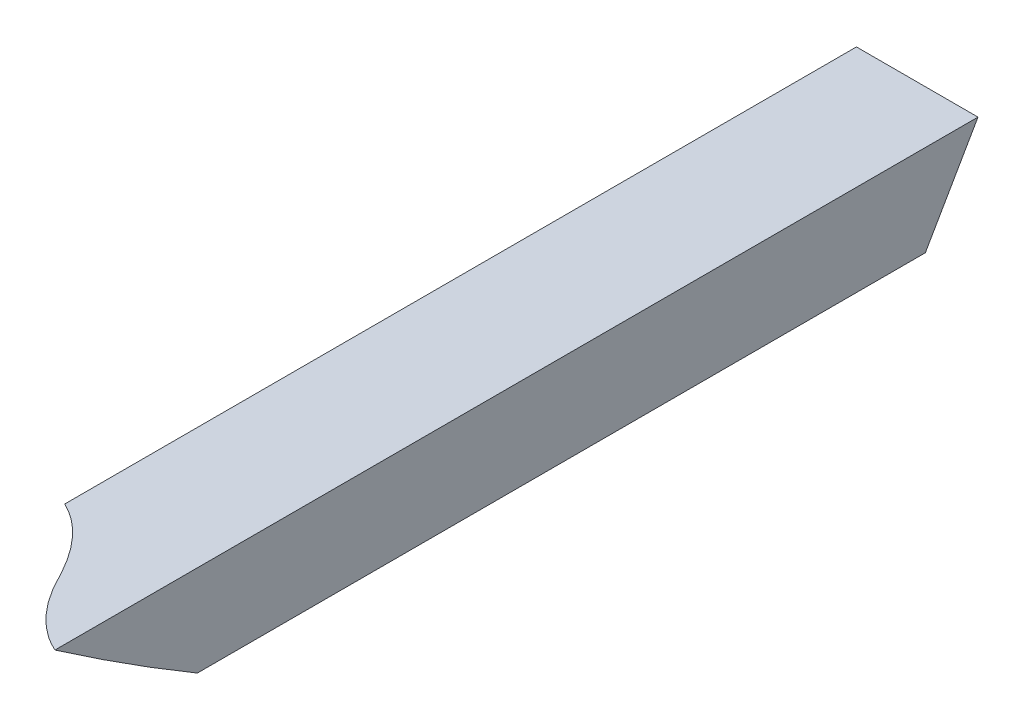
ISO-10303-21;
HEADER;
FILE_DESCRIPTION(('STEP AP214'),'2;1');
FILE_NAME('part.step','',(''),(''),'','','');
FILE_SCHEMA(('AUTOMOTIVE_DESIGN { 1 0 10303 214 1 1 1 1 }'));
ENDSEC;
DATA;
#1=APPLICATION_CONTEXT('core data for automotive mechanical design processes');
#2=APPLICATION_PROTOCOL_DEFINITION('international standard','automotive_design',2000,#1);
#3=PRODUCT_CONTEXT('',#1,'mechanical');
#4=PRODUCT('Part','Part','',(#3));
#5=PRODUCT_RELATED_PRODUCT_CATEGORY('part','',(#4));
#6=PRODUCT_DEFINITION_FORMATION('','',#4);
#7=PRODUCT_DEFINITION_CONTEXT('part definition',#1,'design');
#8=PRODUCT_DEFINITION('design','',#6,#7);
#9=PRODUCT_DEFINITION_SHAPE('','',#8);
#10=(LENGTH_UNIT() NAMED_UNIT(*) SI_UNIT(.MILLI.,.METRE.));
#11=(NAMED_UNIT(*) PLANE_ANGLE_UNIT() SI_UNIT($,.RADIAN.));
#12=(NAMED_UNIT(*) SI_UNIT($,.STERADIAN.) SOLID_ANGLE_UNIT());
#13=UNCERTAINTY_MEASURE_WITH_UNIT(LENGTH_MEASURE(1.E-05),#10,'distance_accuracy_value','');
#14=(GEOMETRIC_REPRESENTATION_CONTEXT(3) GLOBAL_UNCERTAINTY_ASSIGNED_CONTEXT((#13)) GLOBAL_UNIT_ASSIGNED_CONTEXT((#10,
#11,#12)) REPRESENTATION_CONTEXT('',''));
#15=CARTESIAN_POINT('',(0.,0.,0.));
#16=DIRECTION('',(0.,0.,1.));
#17=DIRECTION('',(1.,0.,0.));
#18=AXIS2_PLACEMENT_3D('',#15,#16,#17);
#19=CARTESIAN_POINT('',(0.,-42.1410161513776,82.8766977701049));
#20=DIRECTION('',(0.,1.,0.));
#21=DIRECTION('',(0.,0.,1.));
#22=AXIS2_PLACEMENT_3D('',#19,#20,#21);
#23=CYLINDRICAL_SURFACE('',#22,6.);
#24=CARTESIAN_POINT('',(0.,52.5,82.8766977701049));
#25=DIRECTION('',(0.,1.,0.));
#26=DIRECTION('',(0.,0.,1.));
#27=AXIS2_PLACEMENT_3D('',#24,#25,#26);
#28=CIRCLE('',#27,6.);
#29=CARTESIAN_POINT('',(-0.274833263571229,52.5,76.8829955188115));
#30=VERTEX_POINT('',#29);
#31=CARTESIAN_POINT('',(5.24029925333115,52.5,85.7988996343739));
#32=VERTEX_POINT('',#31);
#33=EDGE_CURVE('E46',#30,#32,#28,.T.);
#34=ORIENTED_EDGE('',*,*,#33,.T.);
#35=CARTESIAN_POINT('',(0.,59.069314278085,88.8766977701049));
#36=CARTESIAN_POINT('',(0.0200249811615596,59.04372412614,88.8766977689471));
#37=CARTESIAN_POINT('',(0.0400313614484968,59.0181194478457,88.8765977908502));
#38=CARTESIAN_POINT('',(0.0801232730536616,58.9669737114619,88.8761961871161));
#39=CARTESIAN_POINT('',(0.100208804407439,58.941432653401,88.8758945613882));
#40=CARTESIAN_POINT('',(0.160537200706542,58.8648707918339,88.8746847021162));
#41=CARTESIAN_POINT('',(0.200851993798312,58.8139111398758,88.8734714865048));
#42=CARTESIAN_POINT('',(0.281677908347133,58.7121736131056,88.8702186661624));
#43=CARTESIAN_POINT('',(0.322189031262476,58.6613957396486,88.8681790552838));
#44=CARTESIAN_POINT('',(0.403382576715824,58.560018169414,88.86326080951));
#45=CARTESIAN_POINT('',(0.444064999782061,58.5094184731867,88.8603821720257));
#46=CARTESIAN_POINT('',(0.566348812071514,58.3578825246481,88.8504686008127));
#47=CARTESIAN_POINT('',(0.648183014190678,58.2572141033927,88.8421561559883));
#48=CARTESIAN_POINT('',(0.812309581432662,58.056603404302,88.8220311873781));
#49=CARTESIAN_POINT('',(0.894601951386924,57.9566611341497,88.8102186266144));
#50=CARTESIAN_POINT('',(1.05949224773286,57.7574981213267,88.7830044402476));
#51=CARTESIAN_POINT('',(1.14209020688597,57.6582774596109,88.7676024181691));
#52=CARTESIAN_POINT('',(1.30740724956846,57.4605831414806,88.7331316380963));
#53=CARTESIAN_POINT('',(1.39012633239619,57.3621094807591,88.7140629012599));
#54=CARTESIAN_POINT('',(1.6381331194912,57.0679050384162,88.6512616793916));
#55=CARTESIAN_POINT('',(1.8033592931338,56.87328381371,88.6019197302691));
#56=CARTESIAN_POINT('',(2.13210119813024,56.4871566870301,88.487795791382));
#57=CARTESIAN_POINT('',(2.29561695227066,56.2956507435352,88.4230140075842));
#58=CARTESIAN_POINT('',(2.61930550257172,55.9159024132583,88.2776888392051));
#59=CARTESIAN_POINT('',(2.77947917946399,55.727659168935,88.1971496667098));
#60=CARTESIAN_POINT('',(3.11901552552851,55.3259120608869,88.0065341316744));
#61=CARTESIAN_POINT('',(3.29755853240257,55.1129564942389,87.8938229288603));
#62=CARTESIAN_POINT('',(3.64526694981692,54.6917395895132,87.6471757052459));
#63=CARTESIAN_POINT('',(3.81443314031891,54.4834778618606,87.5132414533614));
#64=CARTESIAN_POINT('',(4.14045715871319,54.072058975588,87.224569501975));
#65=CARTESIAN_POINT('',(4.29732338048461,53.8688984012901,87.0698461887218));
#66=CARTESIAN_POINT('',(4.5959625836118,53.4679461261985,86.7401903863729));
#67=CARTESIAN_POINT('',(4.73773790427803,53.2701535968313,86.5652610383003));
#68=CARTESIAN_POINT('',(4.98139288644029,52.912578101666,86.2265926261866));
#69=CARTESIAN_POINT('',(5.08599780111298,52.7518993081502,86.0657539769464));
#70=CARTESIAN_POINT('',(5.28091675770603,52.4350797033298,85.7314055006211));
#71=CARTESIAN_POINT('',(5.37123116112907,52.2789387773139,85.5578959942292));
#72=CARTESIAN_POINT('',(5.53579537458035,51.9718253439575,85.1991754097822));
#73=CARTESIAN_POINT('',(5.61005068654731,51.8208510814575,85.0139683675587));
#74=CARTESIAN_POINT('',(5.74076588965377,51.5247909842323,84.6328784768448));
#75=CARTESIAN_POINT('',(5.79722957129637,51.3797039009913,84.436997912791));
#76=CARTESIAN_POINT('',(5.88098142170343,51.1255554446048,84.0770455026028));
#77=CARTESIAN_POINT('',(5.91188067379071,51.0152178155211,83.9147089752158));
#78=CARTESIAN_POINT('',(5.96040406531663,50.7995577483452,83.5847836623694));
#79=CARTESIAN_POINT('',(5.97802865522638,50.6942351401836,83.4171950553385));
#80=CARTESIAN_POINT('',(5.99903938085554,50.4895220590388,83.0777133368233));
#81=CARTESIAN_POINT('',(6.00243792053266,50.390126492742,82.9058241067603));
#82=CARTESIAN_POINT('',(5.99408393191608,50.1982787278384,82.5586710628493));
#83=CARTESIAN_POINT('',(5.98233506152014,50.105824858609,82.3834080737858));
#84=CARTESIAN_POINT('',(5.93179277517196,49.880620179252,81.9337098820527));
#85=CARTESIAN_POINT('',(5.88171916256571,49.7534993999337,81.6574820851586));
#86=CARTESIAN_POINT('',(5.77520001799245,49.5824829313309,81.2434714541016));
#87=CARTESIAN_POINT('',(5.73445867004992,49.5287547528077,81.1055226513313));
#88=CARTESIAN_POINT('',(5.64218455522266,49.428812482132,80.8305454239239));
#89=CARTESIAN_POINT('',(5.59065868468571,49.3825936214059,80.6935164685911));
#90=CARTESIAN_POINT('',(5.48734435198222,49.3066410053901,80.4470044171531));
#91=CARTESIAN_POINT('',(5.43742586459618,49.2754415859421,80.3371852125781));
#92=CARTESIAN_POINT('',(5.33035594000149,49.2193541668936,80.119525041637));
#93=CARTESIAN_POINT('',(5.27320807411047,49.1944630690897,80.0116831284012));
#94=CARTESIAN_POINT('',(5.1517893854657,49.1516284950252,79.7986973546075));
#95=CARTESIAN_POINT('',(5.08752096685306,49.133682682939,79.6935525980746));
#96=CARTESIAN_POINT('',(4.95210077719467,49.1053510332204,79.4867161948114));
#97=CARTESIAN_POINT('',(4.88094893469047,49.0949652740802,79.3850245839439));
#98=CARTESIAN_POINT('',(4.73171409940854,49.0822724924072,79.1852859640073));
#99=CARTESIAN_POINT('',(4.65358928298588,49.0800181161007,79.087266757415));
#100=CARTESIAN_POINT('',(4.49144179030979,49.0841832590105,78.8964179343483));
#101=CARTESIAN_POINT('',(4.40741913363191,49.0906027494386,78.8035883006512));
#102=CARTESIAN_POINT('',(4.23432877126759,49.1123861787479,78.6239323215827));
#103=CARTESIAN_POINT('',(4.14526285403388,49.1277469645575,78.5371038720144));
#104=CARTESIAN_POINT('',(3.96303064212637,49.1674745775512,78.3700734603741));
#105=CARTESIAN_POINT('',(3.86986464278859,49.1918407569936,78.2898710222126));
#106=CARTESIAN_POINT('',(3.69021938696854,49.2464566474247,78.1444427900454));
#107=CARTESIAN_POINT('',(3.60403576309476,49.2758453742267,78.0785247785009));
#108=CARTESIAN_POINT('',(3.42999319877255,49.3414809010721,77.9526057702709));
#109=CARTESIAN_POINT('',(3.34213441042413,49.3777270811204,77.8926042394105));
#110=CARTESIAN_POINT('',(3.16545817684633,49.4567215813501,77.7785674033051));
#111=CARTESIAN_POINT('',(3.07664055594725,49.4994711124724,77.7245332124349));
#112=CARTESIAN_POINT('',(2.8987206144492,49.5910254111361,77.6223711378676));
#113=CARTESIAN_POINT('',(2.80961823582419,49.6398315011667,77.5742445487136));
#114=CARTESIAN_POINT('',(2.59959873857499,49.7616383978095,77.467397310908));
#115=CARTESIAN_POINT('',(2.47880719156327,49.8370134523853,77.4111232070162));
#116=CARTESIAN_POINT('',(2.23895662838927,49.9968097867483,77.3085646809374));
#117=CARTESIAN_POINT('',(2.11989846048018,50.0812353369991,77.26228500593));
#118=CARTESIAN_POINT('',(1.88425223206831,50.2580034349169,77.1788703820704));
#119=CARTESIAN_POINT('',(1.76766768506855,50.3503564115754,77.1417477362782));
#120=CARTESIAN_POINT('',(1.53776998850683,50.5417205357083,77.0758738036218));
#121=CARTESIAN_POINT('',(1.42445561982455,50.6407291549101,77.0471193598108));
#122=CARTESIAN_POINT('',(1.16856950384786,50.8744651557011,76.9897341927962));
#123=CARTESIAN_POINT('',(1.02719759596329,51.0111316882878,76.9636284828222));
#124=CARTESIAN_POINT('',(0.819891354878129,51.2220450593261,76.9325692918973));
#125=CARTESIAN_POINT('',(0.751534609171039,51.2933876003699,76.923562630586));
#126=CARTESIAN_POINT('',(0.61643585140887,51.4378548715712,76.9080605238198));
#127=CARTESIAN_POINT('',(0.549693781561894,51.5109795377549,76.9015649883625));
#128=CARTESIAN_POINT('',(0.417745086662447,51.6589426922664,76.8908915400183));
#129=CARTESIAN_POINT('',(0.352540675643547,51.7337833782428,76.8867167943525));
#130=CARTESIAN_POINT('',(0.255951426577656,51.8471439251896,76.8820728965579));
#131=CARTESIAN_POINT('',(0.223957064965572,51.8851150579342,76.8807946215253));
#132=CARTESIAN_POINT('',(0.160375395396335,51.9614098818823,76.8787571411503));
#133=CARTESIAN_POINT('',(0.128788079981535,51.9997335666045,76.8779979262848));
#134=CARTESIAN_POINT('',(0.0816329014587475,52.0575484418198,76.8772324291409));
#135=CARTESIAN_POINT('',(0.0659180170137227,52.076917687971,76.8770394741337));
#136=CARTESIAN_POINT('',(0.0346028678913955,52.1157495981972,76.8767770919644));
#137=CARTESIAN_POINT('',(0.019002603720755,52.1352122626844,76.8767076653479));
#138=CARTESIAN_POINT('',(-0.0121487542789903,52.1741772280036,76.876689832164));
#139=CARTESIAN_POINT('',(-0.0276998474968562,52.1936795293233,76.876741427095));
#140=CARTESIAN_POINT('',(-0.0588576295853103,52.232638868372,76.8769662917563));
#141=CARTESIAN_POINT('',(-0.0744643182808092,52.2520959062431,76.8771395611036));
#142=CARTESIAN_POINT('',(-0.12132735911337,52.310428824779,76.8778431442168));
#143=CARTESIAN_POINT('',(-0.152627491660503,52.3492675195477,76.8785572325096));
#144=CARTESIAN_POINT('',(-0.215355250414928,52.4268289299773,76.880481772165));
#145=CARTESIAN_POINT('',(-0.246782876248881,52.4655516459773,76.8816922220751));
#146=CARTESIAN_POINT('',(-0.341163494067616,52.5814614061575,76.886074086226));
#147=CARTESIAN_POINT('',(-0.404288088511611,52.6584819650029,76.8899970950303));
#148=CARTESIAN_POINT('',(-0.530926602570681,52.8120720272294,76.8998967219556));
#149=CARTESIAN_POINT('',(-0.594440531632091,52.8886415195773,76.9058733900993));
#150=CARTESIAN_POINT('',(-0.721762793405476,53.04130401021,76.9199235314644));
#151=CARTESIAN_POINT('',(-0.785571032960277,53.117397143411,76.9279963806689));
#152=CARTESIAN_POINT('',(-0.91342314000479,53.2691257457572,76.9462822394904));
#153=CARTESIAN_POINT('',(-0.977467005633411,53.3447612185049,76.956495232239));
#154=CARTESIAN_POINT('',(-1.10982058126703,53.5004045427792,76.9798258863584));
#155=CARTESIAN_POINT('',(-1.17814070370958,53.5803820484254,76.9930877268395));
#156=CARTESIAN_POINT('',(-1.31485785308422,53.7398112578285,77.0221240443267));
#157=CARTESIAN_POINT('',(-1.38325488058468,53.8192629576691,77.0378985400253));
#158=CARTESIAN_POINT('',(-1.58847566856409,54.056901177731,77.0890707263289));
#159=CARTESIAN_POINT('',(-1.72527274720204,54.2143046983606,77.1283072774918));
#160=CARTESIAN_POINT('',(-1.9979264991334,54.5269801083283,77.2172932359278));
#161=CARTESIAN_POINT('',(-2.13378302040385,54.6822516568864,77.267044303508));
#162=CARTESIAN_POINT('',(-2.40316266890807,54.9900777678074,77.3770702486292));
#163=CARTESIAN_POINT('',(-2.53669222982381,55.1426398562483,77.437308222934));
#164=CARTESIAN_POINT('',(-2.80093212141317,55.4455361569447,77.5685403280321));
#165=CARTESIAN_POINT('',(-2.93164281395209,55.5958706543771,77.6395330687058));
#166=CARTESIAN_POINT('',(-3.18925772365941,55.8942636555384,77.792303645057));
#167=CARTESIAN_POINT('',(-3.31616238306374,56.04232242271,77.874080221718));
#168=CARTESIAN_POINT('',(-3.60980466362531,56.3888146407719,78.0796247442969));
#169=CARTESIAN_POINT('',(-3.77452232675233,56.5862894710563,78.2079397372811));
#170=CARTESIAN_POINT('',(-4.09249084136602,56.976861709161,78.483993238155));
#171=CARTESIAN_POINT('',(-4.24574157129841,57.1699590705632,78.6317319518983));
#172=CARTESIAN_POINT('',(-4.53829704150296,57.5517495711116,78.9460495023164));
#173=CARTESIAN_POINT('',(-4.67758935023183,57.740438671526,79.1126448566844));
#174=CARTESIAN_POINT('',(-4.93945104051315,58.112905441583,79.4635273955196));
#175=CARTESIAN_POINT('',(-5.06202293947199,58.2966838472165,79.6478119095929));
#176=CARTESIAN_POINT('',(-5.2703846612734,58.630786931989,80.0029166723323));
#177=CARTESIAN_POINT('',(-5.35893098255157,58.7818829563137,80.171398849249));
#178=CARTESIAN_POINT('',(-5.52073881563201,59.0798127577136,80.5191136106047));
#179=CARTESIAN_POINT('',(-5.59400285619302,59.2266472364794,80.6983444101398));
#180=CARTESIAN_POINT('',(-5.7237022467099,59.5153800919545,81.0663732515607));
#181=CARTESIAN_POINT('',(-5.78015112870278,59.6572823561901,81.2551634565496));
#182=CARTESIAN_POINT('',(-5.87479238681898,59.9354735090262,81.6412596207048));
#183=CARTESIAN_POINT('',(-5.91298865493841,60.0717635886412,81.8385637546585));
#184=CARTESIAN_POINT('',(-5.96372965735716,60.310024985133,82.1986336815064));
#185=CARTESIAN_POINT('',(-5.97995460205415,60.4132445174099,82.3600608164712));
#186=CARTESIAN_POINT('',(-5.99922392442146,60.6147852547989,82.6867359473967));
#187=CARTESIAN_POINT('',(-6.00226870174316,60.7131066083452,82.8519838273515));
#188=CARTESIAN_POINT('',(-5.99437082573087,60.9038924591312,83.1853836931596));
#189=CARTESIAN_POINT('',(-5.98343846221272,60.9963612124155,83.353533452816));
#190=CARTESIAN_POINT('',(-5.94681226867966,61.1743312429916,83.691805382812));
#191=CARTESIAN_POINT('',(-5.92112222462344,61.2598343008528,83.8619270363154));
#192=CARTESIAN_POINT('',(-5.83640644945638,61.4655074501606,84.2933051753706));
#193=CARTESIAN_POINT('',(-5.76694796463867,61.5802028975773,84.5553459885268));
#194=CARTESIAN_POINT('',(-5.63363767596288,61.7325672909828,84.9457768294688));
#195=CARTESIAN_POINT('',(-5.58435105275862,61.7800733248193,85.0754742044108));
#196=CARTESIAN_POINT('',(-5.47585509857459,61.8675372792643,85.3332236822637));
#197=CARTESIAN_POINT('',(-5.41665214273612,61.9075000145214,85.4612767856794));
#198=CARTESIAN_POINT('',(-5.30032511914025,61.9720759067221,85.6909247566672));
#199=CARTESIAN_POINT('',(-5.24490069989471,61.9981623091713,85.7929700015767));
#200=CARTESIAN_POINT('',(-5.12755463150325,62.0439958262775,85.9946753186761));
#201=CARTESIAN_POINT('',(-5.06563619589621,62.0637460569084,86.0943365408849));
#202=CARTESIAN_POINT('',(-4.9354975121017,62.0962901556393,86.2905991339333));
#203=CARTESIAN_POINT('',(-4.8672794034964,62.1090863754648,86.3872015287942));
#204=CARTESIAN_POINT('',(-4.72486934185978,62.1271498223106,86.5766504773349));
#205=CARTESIAN_POINT('',(-4.65067733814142,62.1324169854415,86.6694969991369));
#206=CARTESIAN_POINT('',(-4.49638589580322,62.1349379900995,86.8512169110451));
#207=CARTESIAN_POINT('',(-4.41625425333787,62.1321444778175,86.9400636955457));
#208=CARTESIAN_POINT('',(-4.25117786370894,62.1180897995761,87.1124655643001));
#209=CARTESIAN_POINT('',(-4.16623314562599,62.106828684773,87.1960206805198));
#210=CARTESIAN_POINT('',(-3.99242576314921,62.0756876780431,87.3571637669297));
#211=CARTESIAN_POINT('',(-3.90356478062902,62.0558114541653,87.4347542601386));
#212=CARTESIAN_POINT('',(-3.72285094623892,62.0074999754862,87.5835095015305));
#213=CARTESIAN_POINT('',(-3.63099822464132,61.9790650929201,87.6546745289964));
#214=CARTESIAN_POINT('',(-3.45367030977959,61.9168509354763,87.7841522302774));
#215=CARTESIAN_POINT('',(-3.36836639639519,61.8837842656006,87.8430451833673));
#216=CARTESIAN_POINT('',(-3.19679321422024,61.8111168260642,87.9551838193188));
#217=CARTESIAN_POINT('',(-3.11052360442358,61.7715136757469,88.0084274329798));
#218=CARTESIAN_POINT('',(-2.9376606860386,61.6861846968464,88.1093044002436));
#219=CARTESIAN_POINT('',(-2.8510672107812,61.6404551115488,88.1569342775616));
#220=CARTESIAN_POINT('',(-2.67817192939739,61.5433756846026,88.2466966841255));
#221=CARTESIAN_POINT('',(-2.59187019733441,61.4920245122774,88.2888279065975));
#222=CARTESIAN_POINT('',(-2.38129623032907,61.3598959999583,88.3856221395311));
#223=CARTESIAN_POINT('',(-2.25744884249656,61.2762905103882,88.4373702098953));
#224=CARTESIAN_POINT('',(-2.01250754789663,61.0998557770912,88.530635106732));
#225=CARTESIAN_POINT('',(-1.89141472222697,61.0070229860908,88.5721479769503));
#226=CARTESIAN_POINT('',(-1.65271859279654,60.8135501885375,88.6459376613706));
#227=CARTESIAN_POINT('',(-1.53511577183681,60.7129091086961,88.6782132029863));
#228=CARTESIAN_POINT('',(-1.30384162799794,60.5050536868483,88.7345271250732));
#229=CARTESIAN_POINT('',(-1.19017032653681,60.397839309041,88.7585654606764));
#230=CARTESIAN_POINT('',(-1.01454861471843,60.2247606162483,88.7906579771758));
#231=CARTESIAN_POINT('',(-0.951198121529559,60.1607428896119,88.8011585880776));
#232=CARTESIAN_POINT('',(-0.82588712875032,60.0310602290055,88.8199228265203));
#233=CARTESIAN_POINT('',(-0.763926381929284,59.9653955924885,88.8281868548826));
#234=CARTESIAN_POINT('',(-0.641414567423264,59.8325867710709,88.842633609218));
#235=CARTESIAN_POINT('',(-0.580863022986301,59.7654431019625,88.8488170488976));
#236=CARTESIAN_POINT('',(-0.461067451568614,59.6297035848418,88.8592587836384));
#237=CARTESIAN_POINT('',(-0.401825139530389,59.5611060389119,88.8635146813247));
#238=CARTESIAN_POINT('',(-0.313991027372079,59.4572691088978,88.8685480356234));
#239=CARTESIAN_POINT('',(-0.28488193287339,59.4224968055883,88.8700008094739));
#240=CARTESIAN_POINT('',(-0.227005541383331,59.3526550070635,88.872471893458));
#241=CARTESIAN_POINT('',(-0.198238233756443,59.3175855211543,88.8734902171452));
#242=CARTESIAN_POINT('',(-0.141031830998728,59.2471399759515,88.8751083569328));
#243=CARTESIAN_POINT('',(-0.11259291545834,59.2117637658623,88.8757079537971));
#244=CARTESIAN_POINT('',(-0.0701779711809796,59.1585012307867,88.8763039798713));
#245=CARTESIAN_POINT('',(-0.056079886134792,59.1407135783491,88.8764520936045));
#246=CARTESIAN_POINT('',(-0.0279848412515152,59.10505773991,88.8766489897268));
#247=CARTESIAN_POINT('',(-0.0139878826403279,59.0871895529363,88.8766977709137));
#248=CARTESIAN_POINT('',(0.,59.069314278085,88.8766977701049));
#249=B_SPLINE_CURVE_WITH_KNOTS('',3,(#35,#36,#37,#38,#39,#40,#41,#42,#43,#44,#45,#46,#47,#48,
#49,#50,#51,#52,#53,#54,#55,#56,#57,#58,#59,#60,#61,#62,#63,#64,#65,#66,#67,#68,#69,#70,#71,#72,
#73,#74,#75,#76,#77,#78,#79,#80,#81,#82,#83,#84,#85,#86,#87,#88,#89,#90,#91,#92,#93,#94,#95,#96,
#97,#98,#99,#100,#101,#102,#103,#104,#105,#106,#107,#108,#109,#110,#111,#112,#113,#114,#115,
#116,#117,#118,#119,#120,#121,#122,#123,#124,#125,#126,#127,#128,#129,#130,#131,#132,#133,#134,
#135,#136,#137,#138,#139,#140,#141,#142,#143,#144,#145,#146,#147,#148,#149,#150,#151,#152,#153,
#154,#155,#156,#157,#158,#159,#160,#161,#162,#163,#164,#165,#166,#167,#168,#169,#170,#171,#172,
#173,#174,#175,#176,#177,#178,#179,#180,#181,#182,#183,#184,#185,#186,#187,#188,#189,#190,#191,
#192,#193,#194,#195,#196,#197,#198,#199,#200,#201,#202,#203,#204,#205,#206,#207,#208,#209,#210,
#211,#212,#213,#214,#215,#216,#217,#218,#219,#220,#221,#222,#223,#224,#225,#226,#227,#228,#229,
#230,#231,#232,#233,#234,#235,#236,#237,#238,#239,#240,#241,#242,#243,#244,#245,#246,#247,#248),
.UNSPECIFIED.,.T.,.F.,(4,2,2,2,2,2,2,2,2,2,2,2,2,2,2,2,2,2,2,2,2,2,2,2,2,2,2,2,2,2,2,2,2,2,2,2,
2,2,2,2,2,2,2,2,2,2,2,2,2,2,2,2,2,2,2,2,2,2,2,2,2,2,2,2,2,2,2,2,2,2,2,2,2,2,2,2,2,2,2,2,2,2,2,2,
2,2,2,2,2,2,2,2,2,2,2,2,2,2,2,2,2,2,2,2,2,2,4),(0.,0.0974815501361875,0.194963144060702,
0.389925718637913,0.584889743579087,0.779854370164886,1.16980160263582,1.55975295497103,
1.94974739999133,2.33973959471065,3.11930501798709,3.89886004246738,4.67820696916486,
5.57695248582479,6.47562313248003,7.37367506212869,8.27158757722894,9.02164667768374,
9.77168680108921,10.5214695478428,11.2710924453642,11.8666689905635,12.4622253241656,
13.0572622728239,13.6521555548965,14.5725476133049,15.0327465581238,15.4926521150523,
15.866107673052,16.2393794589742,16.6125255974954,16.9856756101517,17.3612372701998,
17.7367976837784,18.1122257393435,18.4876267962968,18.824482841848,19.1613084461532,
19.4981968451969,19.8351589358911,20.2937517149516,20.7525618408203,21.2119850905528,
21.6712347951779,22.2655907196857,22.5631894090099,22.8607774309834,23.1587705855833,
23.3077751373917,23.4567769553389,23.5316059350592,23.6064352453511,23.6812654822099,
23.7560954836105,23.9057516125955,24.0554073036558,24.3543650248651,24.6533300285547,
24.9522061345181,25.2510798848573,25.569102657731,25.8871277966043,26.5234401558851,
27.159853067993,27.7940701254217,28.4282052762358,29.0622664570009,29.9235145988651,
30.7847718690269,31.6467894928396,32.5086771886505,33.2370197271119,33.9652416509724,
34.6928759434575,35.4203550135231,35.9967257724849,36.5730790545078,37.1490082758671,
37.7247898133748,38.6039821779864,39.0435246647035,39.482785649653,39.8395088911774,
40.1960564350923,40.5524833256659,40.9089132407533,41.2674413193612,41.6259672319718,
41.9843406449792,42.3426984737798,42.6687600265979,42.994940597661,43.3213221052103,
43.6477810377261,44.1214376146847,44.5952769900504,45.0691816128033,45.5430888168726,
45.8150653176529,46.0869930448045,46.3588273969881,46.6309989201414,46.7671095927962,
46.903216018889,47.0393936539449,47.1074858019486,47.1755787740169),.UNSPECIFIED.);
#250=EDGE_CURVE('E11',#30,#32,#249,.T.);
#251=ORIENTED_EDGE('',*,*,#250,.F.);
#252=EDGE_LOOP('',(#34,#251));
#253=FACE_BOUND('',#252,.T.);
#254=ADVANCED_FACE('F33',(#253),#23,.T.);
#255=CARTESIAN_POINT('',(-30.,117.320508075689,163.205080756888));
#256=CARTESIAN_POINT('',(-30.,107.117483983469,152.415825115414));
#257=CARTESIAN_POINT('',(-30.,94.1304442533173,138.682593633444));
#258=CARTESIAN_POINT('',(-30.,76.0781440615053,115.118979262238));
#259=CARTESIAN_POINT('',(-30.,63.1328522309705,96.1586042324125));
#260=CARTESIAN_POINT('',(-30.,48.2906753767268,70.4512062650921));
#261=CARTESIAN_POINT('',(-30.,38.34315405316,49.7601899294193));
#262=CARTESIAN_POINT('',(-30.,26.9626094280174,22.3446571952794));
#263=CARTESIAN_POINT('',(-30.,21.5627895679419,4.2308336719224));
#264=CARTESIAN_POINT('',(-30.,17.3205080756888,-10.));
#265=CARTESIAN_POINT('',(-29.0650994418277,118.238562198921,162.675041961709));
#266=CARTESIAN_POINT('',(-29.0623754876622,108.031252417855,151.889577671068));
#267=CARTESIAN_POINT('',(-29.0589082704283,95.0387575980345,138.161172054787));
#268=CARTESIAN_POINT('',(-29.0557820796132,76.9805247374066,114.600117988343));
#269=CARTESIAN_POINT('',(-29.0543707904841,64.032135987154,95.6401689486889));
#270=CARTESIAN_POINT('',(-29.0543707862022,49.1892948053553,69.9316203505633));
#271=CARTESIAN_POINT('',(-29.0557820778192,39.2436905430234,49.238134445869));
#272=CARTESIAN_POINT('',(-29.0589083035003,27.8683306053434,21.818745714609));
#273=CARTESIAN_POINT('',(-29.0623754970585,22.4754175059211,3.70261079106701));
#274=CARTESIAN_POINT('',(-29.0650994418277,18.2385621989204,-10.5300387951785));
#275=CARTESIAN_POINT('',(-26.9698133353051,119.902394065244,161.714428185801));
#276=CARTESIAN_POINT('',(-26.9618430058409,109.684748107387,150.937310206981));
#277=CARTESIAN_POINT('',(-26.9516978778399,96.6790967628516,137.219528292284));
#278=CARTESIAN_POINT('',(-26.9430182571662,78.6078459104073,113.664420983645));
#279=CARTESIAN_POINT('',(-26.9390611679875,65.6527599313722,94.7058822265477));
#280=CARTESIAN_POINT('',(-26.9390611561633,50.808721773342,68.9952604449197));
#281=CARTESIAN_POINT('',(-26.9430182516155,40.8676868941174,48.2966787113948));
#282=CARTESIAN_POINT('',(-26.9516979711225,29.5039879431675,20.8689924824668));
#283=CARTESIAN_POINT('',(-26.9618430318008,24.1268532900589,2.74677538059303));
#284=CARTESIAN_POINT('',(-26.9698133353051,19.9023940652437,-11.4906525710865));
#285=CARTESIAN_POINT('',(-23.2906453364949,121.769380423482,160.636523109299));
#286=CARTESIAN_POINT('',(-23.28048493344,111.537390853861,149.870346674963));
#287=CARTESIAN_POINT('',(-23.2675521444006,98.51348207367,136.166491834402));
#288=CARTESIAN_POINT('',(-23.2555317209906,80.4222369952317,112.621158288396));
#289=CARTESIAN_POINT('',(-23.2501997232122,67.4575031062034,93.6654505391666));
#290=CARTESIAN_POINT('',(-23.2501997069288,52.6121324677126,67.9525208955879));
#291=CARTESIAN_POINT('',(-23.2555317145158,42.6783726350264,47.2469982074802));
#292=CARTESIAN_POINT('',(-23.2675522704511,31.3331373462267,19.8068867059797));
#293=CARTESIAN_POINT('',(-23.2804849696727,25.9771923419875,1.67582159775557));
#294=CARTESIAN_POINT('',(-23.2906453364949,21.7693804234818,-12.5685576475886));
#295=CARTESIAN_POINT('',(-19.2402865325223,122.92413557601,159.96982491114));
#296=CARTESIAN_POINT('',(-19.2329440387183,112.678853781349,149.212954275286));
#297=CARTESIAN_POINT('',(-19.223598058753,99.6380258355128,135.52094443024));
#298=CARTESIAN_POINT('',(-19.2158622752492,81.5330652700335,111.982438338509));
#299=CARTESIAN_POINT('',(-19.2123403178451,68.5614053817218,93.0290523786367));
#300=CARTESIAN_POINT('',(-19.2123403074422,53.7152198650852,67.3147113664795));
#301=CARTESIAN_POINT('',(-19.2158622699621,43.786933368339,46.604350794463));
#302=CARTESIAN_POINT('',(-19.2235981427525,32.4544699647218,19.1557770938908));
#303=CARTESIAN_POINT('',(-19.2329440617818,27.117242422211,1.0159819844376));
#304=CARTESIAN_POINT('',(-19.2402865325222,22.9241355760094,-13.2352558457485));
#305=CARTESIAN_POINT('',(-15.,123.314869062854,159.744234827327));
#306=CARTESIAN_POINT('',(-15.,113.067208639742,148.989296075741));
#307=CARTESIAN_POINT('',(-15.0000000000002,100.023353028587,135.299745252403));
#308=CARTESIAN_POINT('',(-14.9999999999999,81.9123877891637,111.764330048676));
#309=CARTESIAN_POINT('',(-15.,68.9381821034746,92.8118410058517));
#310=CARTESIAN_POINT('',(-15.0000000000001,54.0917185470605,67.0970184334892));
#311=CARTESIAN_POINT('',(-14.9999999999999,44.1654815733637,46.384901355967));
#312=CARTESIAN_POINT('',(-15.0000000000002,32.8386977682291,18.9326735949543));
#313=CARTESIAN_POINT('',(-15.0000000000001,27.5051135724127,0.791485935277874));
#314=CARTESIAN_POINT('',(-15.,23.3148690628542,-13.4608459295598));
#315=CARTESIAN_POINT('',(-10.7597134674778,122.92413557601,159.96982491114));
#316=CARTESIAN_POINT('',(-10.7670559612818,112.678853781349,149.212954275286));
#317=CARTESIAN_POINT('',(-10.776401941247,99.638025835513,135.52094443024));
#318=CARTESIAN_POINT('',(-10.7841377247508,81.5330652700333,111.982438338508));
#319=CARTESIAN_POINT('',(-10.7876596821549,68.5614053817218,93.0290523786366));
#320=CARTESIAN_POINT('',(-10.7876596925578,53.7152198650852,67.3147113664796));
#321=CARTESIAN_POINT('',(-10.784137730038,43.7869333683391,46.6043507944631));
#322=CARTESIAN_POINT('',(-10.7764018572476,32.4544699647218,19.1557770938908));
#323=CARTESIAN_POINT('',(-10.7670559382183,27.117242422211,1.01598198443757));
#324=CARTESIAN_POINT('',(-10.7597134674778,22.9241355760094,-13.2352558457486));
#325=CARTESIAN_POINT('',(-6.70935466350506,121.769380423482,160.636523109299));
#326=CARTESIAN_POINT('',(-6.71951506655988,111.537390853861,149.870346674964));
#327=CARTESIAN_POINT('',(-6.73244785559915,98.5134820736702,136.166491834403));
#328=CARTESIAN_POINT('',(-6.74446827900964,80.4222369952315,112.621158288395));
#329=CARTESIAN_POINT('',(-6.74980027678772,67.4575031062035,93.6654505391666));
#330=CARTESIAN_POINT('',(-6.74980029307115,52.6121324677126,67.9525208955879));
#331=CARTESIAN_POINT('',(-6.74446828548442,42.6783726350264,47.2469982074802));
#332=CARTESIAN_POINT('',(-6.73244772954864,31.3331373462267,19.8068867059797));
#333=CARTESIAN_POINT('',(-6.71951503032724,25.9771923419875,1.67582159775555));
#334=CARTESIAN_POINT('',(-6.7093546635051,21.7693804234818,-12.5685576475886));
#335=CARTESIAN_POINT('',(-3.03018666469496,119.902394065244,161.714428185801));
#336=CARTESIAN_POINT('',(-3.03815699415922,109.684748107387,150.937310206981));
#337=CARTESIAN_POINT('',(-3.04830212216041,96.6790967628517,137.219528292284));
#338=CARTESIAN_POINT('',(-3.05698174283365,78.6078459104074,113.664420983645));
#339=CARTESIAN_POINT('',(-3.06093883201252,65.6527599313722,94.7058822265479));
#340=CARTESIAN_POINT('',(-3.06093884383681,50.8087217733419,68.9952604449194));
#341=CARTESIAN_POINT('',(-3.0569817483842,40.8676868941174,48.2966787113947));
#342=CARTESIAN_POINT('',(-3.04830202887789,29.5039879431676,20.8689924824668));
#343=CARTESIAN_POINT('',(-3.03815696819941,24.126853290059,2.74677538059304));
#344=CARTESIAN_POINT('',(-3.03018666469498,19.9023940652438,-11.4906525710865));
#345=CARTESIAN_POINT('',(-0.934900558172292,118.238562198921,162.675041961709));
#346=CARTESIAN_POINT('',(-0.937624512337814,108.031252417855,151.889577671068));
#347=CARTESIAN_POINT('',(-0.941091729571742,95.0387575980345,138.161172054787));
#348=CARTESIAN_POINT('',(-0.944217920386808,76.9805247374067,114.600117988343));
#349=CARTESIAN_POINT('',(-0.945629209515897,64.0321359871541,95.6401689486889));
#350=CARTESIAN_POINT('',(-0.945629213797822,49.1892948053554,69.9316203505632));
#351=CARTESIAN_POINT('',(-0.944217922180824,39.2436905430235,49.2381344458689));
#352=CARTESIAN_POINT('',(-0.94109169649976,27.8683306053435,21.8187457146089));
#353=CARTESIAN_POINT('',(-0.937624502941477,22.4754175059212,3.70261079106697));
#354=CARTESIAN_POINT('',(-0.934900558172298,18.2385621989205,-10.5300387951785));
#355=CARTESIAN_POINT('',(0.93490055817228,116.402453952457,163.735119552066));
#356=CARTESIAN_POINT('',(0.937624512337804,106.203715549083,152.94207255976));
#357=CARTESIAN_POINT('',(0.941091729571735,93.2221309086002,139.2040152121));
#358=CARTESIAN_POINT('',(0.944217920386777,75.175763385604,115.637840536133));
#359=CARTESIAN_POINT('',(0.945629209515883,62.233568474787,96.6770395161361));
#360=CARTESIAN_POINT('',(0.945629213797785,47.3920559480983,70.9707921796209));
#361=CARTESIAN_POINT('',(0.944217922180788,37.4426175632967,50.2822454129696));
#362=CARTESIAN_POINT('',(0.941091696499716,26.0568882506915,22.8705686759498));
#363=CARTESIAN_POINT('',(0.937624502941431,20.6501616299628,4.75905655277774));
#364=CARTESIAN_POINT('',(0.93490055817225,16.4024539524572,-9.46996120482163));
#365=CARTESIAN_POINT('',(3.03018666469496,114.738622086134,164.695733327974));
#366=CARTESIAN_POINT('',(3.03815699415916,104.550219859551,153.894340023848));
#367=CARTESIAN_POINT('',(3.04830212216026,91.5817917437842,140.145658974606));
#368=CARTESIAN_POINT('',(3.0569817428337,73.548442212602,116.573537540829));
#369=CARTESIAN_POINT('',(3.06093883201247,60.6129445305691,97.6113262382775));
#370=CARTESIAN_POINT('',(3.06093884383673,45.772628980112,71.907152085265));
#371=CARTESIAN_POINT('',(3.05698174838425,35.8186212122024,51.2237011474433));
#372=CARTESIAN_POINT('',(3.04830202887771,24.4212309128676,23.8203219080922));
#373=CARTESIAN_POINT('',(3.03815696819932,18.9987258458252,5.71489196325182));
#374=CARTESIAN_POINT('',(3.03018666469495,14.7386220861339,-8.50934742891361));
#375=CARTESIAN_POINT('',(6.70935466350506,112.871635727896,165.773638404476));
#376=CARTESIAN_POINT('',(6.71951506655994,102.697577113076,154.961303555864));
#377=CARTESIAN_POINT('',(6.7324478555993,89.7474064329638,141.198695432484));
#378=CARTESIAN_POINT('',(6.74446827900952,71.73405112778,117.616800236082));
#379=CARTESIAN_POINT('',(6.74980027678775,58.8082013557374,98.6517579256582));
#380=CARTESIAN_POINT('',(6.74980029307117,43.969218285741,72.949891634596));
#381=CARTESIAN_POINT('',(6.74446828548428,34.007935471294,52.2733816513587));
#382=CARTESIAN_POINT('',(6.73244772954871,22.5920815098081,24.8824276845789));
#383=CARTESIAN_POINT('',(6.71951503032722,17.1483867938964,6.78584574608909));
#384=CARTESIAN_POINT('',(6.70935466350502,12.8716357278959,-7.4314423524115));
#385=CARTESIAN_POINT('',(10.7597134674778,111.716880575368,166.440336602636));
#386=CARTESIAN_POINT('',(10.7670559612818,101.556114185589,155.618695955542));
#387=CARTESIAN_POINT('',(10.776401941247,88.6228626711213,141.844242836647));
#388=CARTESIAN_POINT('',(10.7841377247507,70.6232228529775,118.255520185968));
#389=CARTESIAN_POINT('',(10.7876596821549,57.7042990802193,99.2881560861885));
#390=CARTESIAN_POINT('',(10.7876596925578,42.8661308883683,73.5877011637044));
#391=CARTESIAN_POINT('',(10.7841377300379,32.8993747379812,52.9160290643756));
#392=CARTESIAN_POINT('',(10.7764018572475,21.4707488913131,25.5335372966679));
#393=CARTESIAN_POINT('',(10.7670559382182,16.008336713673,7.44568535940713));
#394=CARTESIAN_POINT('',(10.7597134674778,11.7168805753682,-6.76474415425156));
#395=CARTESIAN_POINT('',(15.,111.326147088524,166.665926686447));
#396=CARTESIAN_POINT('',(15.,101.167759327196,155.842354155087));
#397=CARTESIAN_POINT('',(15.,88.2375354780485,142.065442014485));
#398=CARTESIAN_POINT('',(15.,70.243900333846,118.473628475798));
#399=CARTESIAN_POINT('',(15.,57.3275223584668,99.5053674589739));
#400=CARTESIAN_POINT('',(15.,42.4896322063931,73.8053940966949));
#401=CARTESIAN_POINT('',(14.9999999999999,32.5208265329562,53.1354785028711));
#402=CARTESIAN_POINT('',(15.,21.086521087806,25.7566407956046));
#403=CARTESIAN_POINT('',(14.9999999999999,15.6204655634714,7.67018140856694));
#404=CARTESIAN_POINT('',(14.9999999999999,11.3261470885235,-6.53915407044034));
#405=CARTESIAN_POINT('',(19.2402865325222,111.716880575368,166.440336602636));
#406=CARTESIAN_POINT('',(19.2329440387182,101.556114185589,155.618695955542));
#407=CARTESIAN_POINT('',(19.223598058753,88.6228626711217,141.844242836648));
#408=CARTESIAN_POINT('',(19.2158622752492,70.6232228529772,118.255520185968));
#409=CARTESIAN_POINT('',(19.2123403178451,57.7042990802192,99.2881560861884));
#410=CARTESIAN_POINT('',(19.2123403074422,42.8661308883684,73.5877011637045));
#411=CARTESIAN_POINT('',(19.215862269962,32.8993747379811,52.9160290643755));
#412=CARTESIAN_POINT('',(19.2235981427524,21.4707488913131,25.5335372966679));
#413=CARTESIAN_POINT('',(19.2329440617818,16.008336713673,7.44568535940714));
#414=CARTESIAN_POINT('',(19.2402865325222,11.7168805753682,-6.76474415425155));
#415=CARTESIAN_POINT('',(23.2906453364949,112.871635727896,165.773638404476));
#416=CARTESIAN_POINT('',(23.28048493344,102.697577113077,154.961303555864));
#417=CARTESIAN_POINT('',(23.2675521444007,89.7474064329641,141.198695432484));
#418=CARTESIAN_POINT('',(23.2555317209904,71.7340511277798,117.616800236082));
#419=CARTESIAN_POINT('',(23.2501997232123,58.8082013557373,98.6517579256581));
#420=CARTESIAN_POINT('',(23.2501997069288,43.969218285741,72.9498916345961));
#421=CARTESIAN_POINT('',(23.2555317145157,34.007935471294,52.2733816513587));
#422=CARTESIAN_POINT('',(23.2675522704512,22.5920815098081,24.8824276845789));
#423=CARTESIAN_POINT('',(23.2804849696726,17.1483867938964,6.78584574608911));
#424=CARTESIAN_POINT('',(23.2906453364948,12.8716357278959,-7.4314423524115));
#425=CARTESIAN_POINT('',(26.969813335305,114.738622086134,164.695733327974));
#426=CARTESIAN_POINT('',(26.9618430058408,104.550219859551,153.894340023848));
#427=CARTESIAN_POINT('',(26.9516978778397,91.5817917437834,140.145658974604));
#428=CARTESIAN_POINT('',(26.9430182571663,73.5484422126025,116.57353754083));
#429=CARTESIAN_POINT('',(26.9390611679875,60.6129445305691,97.6113262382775));
#430=CARTESIAN_POINT('',(26.9390611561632,45.7726289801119,71.9071520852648));
#431=CARTESIAN_POINT('',(26.9430182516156,35.8186212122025,51.2237011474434));
#432=CARTESIAN_POINT('',(26.9516979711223,24.4212309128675,23.8203219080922));
#433=CARTESIAN_POINT('',(26.9618430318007,18.9987258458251,5.7148919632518));
#434=CARTESIAN_POINT('',(26.969813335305,14.7386220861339,-8.50934742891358));
#435=CARTESIAN_POINT('',(29.0650994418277,116.402453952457,163.735119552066));
#436=CARTESIAN_POINT('',(29.0623754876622,106.203715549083,152.94207255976));
#437=CARTESIAN_POINT('',(29.0589082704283,93.2221309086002,139.2040152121));
#438=CARTESIAN_POINT('',(29.0557820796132,75.1757633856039,115.637840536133));
#439=CARTESIAN_POINT('',(29.0543707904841,62.233568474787,96.6770395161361));
#440=CARTESIAN_POINT('',(29.0543707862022,47.3920559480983,70.9707921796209));
#441=CARTESIAN_POINT('',(29.0557820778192,37.4426175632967,50.2822454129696));
#442=CARTESIAN_POINT('',(29.0589083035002,26.0568882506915,22.8705686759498));
#443=CARTESIAN_POINT('',(29.0623754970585,20.6501616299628,4.75905655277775));
#444=CARTESIAN_POINT('',(29.0650994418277,16.4024539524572,-9.46996120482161));
#445=CARTESIAN_POINT('',(30.,117.320508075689,163.205080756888));
#446=CARTESIAN_POINT('',(30.,107.117483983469,152.415825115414));
#447=CARTESIAN_POINT('',(30.,94.1304442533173,138.682593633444));
#448=CARTESIAN_POINT('',(30.,76.0781440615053,115.118979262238));
#449=CARTESIAN_POINT('',(30.,63.1328522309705,96.1586042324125));
#450=CARTESIAN_POINT('',(30.,48.2906753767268,70.4512062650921));
#451=CARTESIAN_POINT('',(30.,38.34315405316,49.7601899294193));
#452=CARTESIAN_POINT('',(30.,26.9626094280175,22.3446571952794));
#453=CARTESIAN_POINT('',(30.,21.562789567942,4.23083367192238));
#454=CARTESIAN_POINT('',(30.,17.3205080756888,-10.));
#455=B_SPLINE_SURFACE_WITH_KNOTS('',3,3,((#255,#256,#257,#258,#259,#260,#261,#262,#263,#264),
(#265,#266,#267,#268,#269,#270,#271,#272,#273,#274),(#275,#276,#277,#278,#279,#280,#281,#282,
#283,#284),(#285,#286,#287,#288,#289,#290,#291,#292,#293,#294),(#295,#296,#297,#298,#299,#300,
#301,#302,#303,#304),(#305,#306,#307,#308,#309,#310,#311,#312,#313,#314),(#315,#316,#317,#318,
#319,#320,#321,#322,#323,#324),(#325,#326,#327,#328,#329,#330,#331,#332,#333,#334),(#335,#336,
#337,#338,#339,#340,#341,#342,#343,#344),(#345,#346,#347,#348,#349,#350,#351,#352,#353,#354),
(#355,#356,#357,#358,#359,#360,#361,#362,#363,#364),(#365,#366,#367,#368,#369,#370,#371,#372,
#373,#374),(#375,#376,#377,#378,#379,#380,#381,#382,#383,#384),(#385,#386,#387,#388,#389,#390,
#391,#392,#393,#394),(#395,#396,#397,#398,#399,#400,#401,#402,#403,#404),(#405,#406,#407,#408,
#409,#410,#411,#412,#413,#414),(#415,#416,#417,#418,#419,#420,#421,#422,#423,#424),(#425,#426,
#427,#428,#429,#430,#431,#432,#433,#434),(#435,#436,#437,#438,#439,#440,#441,#442,#443,#444),
(#445,#446,#447,#448,#449,#450,#451,#452,#453,#454)),.UNSPECIFIED.,.F.,.F.,.F.,(4,1,1,1,1,1,1,1,
2,1,1,1,1,1,1,1,4),(4,1,1,1,1,1,1,4),(0.,0.0625,0.125,0.1875,0.25,0.3125,0.375,0.4375,0.5,
0.5625,0.625,0.6875,0.75,0.8125,0.875,0.9375,1.),(0.,0.219963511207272,0.279983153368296,
0.43999217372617,0.560007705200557,0.720015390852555,0.780034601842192,1.),.UNSPECIFIED.);
#456=CARTESIAN_POINT('',(10.,52.5,89.4558884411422));
#457=CARTESIAN_POINT('',(9.66295801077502,52.5,89.2902894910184));
#458=CARTESIAN_POINT('',(9.33322016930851,52.5,89.1103350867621));
#459=CARTESIAN_POINT('',(8.69051086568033,52.5,88.7259474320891));
#460=CARTESIAN_POINT('',(8.37746452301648,52.5,88.5216396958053));
#461=CARTESIAN_POINT('',(7.76742157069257,52.5,88.0914057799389));
#462=CARTESIAN_POINT('',(7.47040093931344,52.5,87.8655134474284));
#463=CARTESIAN_POINT('',(6.90230579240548,52.5,87.4031192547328));
#464=CARTESIAN_POINT('',(6.63068274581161,52.5,87.1672886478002));
#465=CARTESIAN_POINT('',(6.10128377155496,52.5,86.6799898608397));
#466=CARTESIAN_POINT('',(5.84352522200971,52.5,86.4285028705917));
#467=CARTESIAN_POINT('',(5.34142828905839,52.5,85.9120140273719));
#468=CARTESIAN_POINT('',(5.09710372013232,52.5,85.6469987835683));
#469=CARTESIAN_POINT('',(4.65345547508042,52.5,85.1417537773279));
#470=CARTESIAN_POINT('',(4.4524884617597,52.5,84.9029606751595));
#471=CARTESIAN_POINT('',(4.06003570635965,52.5,84.4177530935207));
#472=CARTESIAN_POINT('',(3.86854907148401,52.5,84.1713393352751));
#473=CARTESIAN_POINT('',(3.4946919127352,52.5,83.6717721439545));
#474=CARTESIAN_POINT('',(3.31231977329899,52.5,83.4186199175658));
#475=CARTESIAN_POINT('',(2.95637795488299,52.5,82.9064133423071));
#476=CARTESIAN_POINT('',(2.78280355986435,52.5,82.6473622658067));
#477=CARTESIAN_POINT('',(2.44415868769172,52.5,82.1241900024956));
#478=CARTESIAN_POINT('',(2.27907872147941,52.5,81.8600749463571));
#479=CARTESIAN_POINT('',(1.9535430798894,52.5,81.3215938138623));
#480=CARTESIAN_POINT('',(1.79325144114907,52.5,81.047128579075));
#481=CARTESIAN_POINT('',(1.55876130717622,52.5,80.6321326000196));
#482=CARTESIAN_POINT('',(1.4815977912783,52.5,80.4932672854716));
#483=CARTESIAN_POINT('',(1.32920146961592,52.5,80.2144816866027));
#484=CARTESIAN_POINT('',(1.25396864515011,52.5,80.0745614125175));
#485=CARTESIAN_POINT('',(1.10536858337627,52.5,79.7936767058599));
#486=CARTESIAN_POINT('',(1.03200195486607,52.5,79.6527119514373));
#487=CARTESIAN_POINT('',(0.887117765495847,52.5,79.3698313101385));
#488=CARTESIAN_POINT('',(0.815600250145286,52.5,79.2279153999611));
#489=CARTESIAN_POINT('',(0.674320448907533,52.5,78.9430687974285));
#490=CARTESIAN_POINT('',(0.604559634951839,52.5,78.8001373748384));
#491=CARTESIAN_POINT('',(0.501254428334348,52.5,78.585104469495));
#492=CARTESIAN_POINT('',(0.467042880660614,52.5,78.5133227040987));
#493=CARTESIAN_POINT('',(0.399060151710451,52.5,78.3695503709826));
#494=CARTESIAN_POINT('',(0.365288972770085,52.5,78.2975598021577));
#495=CARTESIAN_POINT('',(0.298142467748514,52.5,78.1532949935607));
#496=CARTESIAN_POINT('',(0.264767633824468,52.5,78.0810205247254));
#497=CARTESIAN_POINT('',(0.198457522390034,52.5,77.9362713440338));
#498=CARTESIAN_POINT('',(0.165522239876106,52.5,77.8637966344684));
#499=CARTESIAN_POINT('',(0.100052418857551,52.5,77.7186614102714));
#500=CARTESIAN_POINT('',(0.067517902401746,52.5,77.6460008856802));
#501=CARTESIAN_POINT('',(0.0191053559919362,52.5,77.5368372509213));
#502=CARTESIAN_POINT('',(0.00303263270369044,52.5,77.5004203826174));
#503=CARTESIAN_POINT('',(-0.0291811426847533,52.5,77.4276169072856));
#504=CARTESIAN_POINT('',(-0.0453221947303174,52.5,77.3912303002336));
#505=CARTESIAN_POINT('',(-0.0839451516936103,52.5,77.3044830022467));
#506=CARTESIAN_POINT('',(-0.106472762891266,52.5,77.2541426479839));
#507=CARTESIAN_POINT('',(-0.151706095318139,52.5,77.153541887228));
#508=CARTESIAN_POINT('',(-0.174411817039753,52.5,77.1032814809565));
#509=CARTESIAN_POINT('',(-0.242802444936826,52.5,76.952624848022));
#510=CARTESIAN_POINT('',(-0.288760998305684,52.5,76.8523527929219));
#511=CARTESIAN_POINT('',(-0.427736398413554,52.5,76.5520549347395));
#512=CARTESIAN_POINT('',(-0.521856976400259,52.5,76.3525384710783));
#513=CARTESIAN_POINT('',(-0.712993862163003,52.5,75.9552031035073));
#514=CARTESIAN_POINT('',(-0.810006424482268,52.5,75.7573823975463));
#515=CARTESIAN_POINT('',(-1.00711849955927,52.5,75.3632770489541));
#516=CARTESIAN_POINT('',(-1.10721810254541,52.5,75.166992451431));
#517=CARTESIAN_POINT('',(-1.31052578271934,52.5,74.7761847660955));
#518=CARTESIAN_POINT('',(-1.41373199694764,52.5,74.5816607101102));
#519=CARTESIAN_POINT('',(-1.62339704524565,52.5,74.1943794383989));
#520=CARTESIAN_POINT('',(-1.72985583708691,52.5,74.0016221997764));
#521=CARTESIAN_POINT('',(-2.0543285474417,52.5,73.4260593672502));
#522=CARTESIAN_POINT('',(-2.27738172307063,52.5,73.0460727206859));
#523=CARTESIAN_POINT('',(-2.73329215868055,52.5,72.3021855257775));
#524=CARTESIAN_POINT('',(-2.96587304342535,52.5,71.9381157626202));
#525=CARTESIAN_POINT('',(-3.4460022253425,52.5,71.2194251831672));
#526=CARTESIAN_POINT('',(-3.69356525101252,52.5,70.8648141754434));
#527=CARTESIAN_POINT('',(-4.20450103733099,52.5,70.1670943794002));
#528=CARTESIAN_POINT('',(-4.46787490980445,52.5,69.8239864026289));
#529=CARTESIAN_POINT('',(-5.01154162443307,52.5,69.1515139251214));
#530=CARTESIAN_POINT('',(-5.29183095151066,52.5,68.8221465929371));
#531=CARTESIAN_POINT('',(-5.89642853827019,52.5,68.1511849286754));
#532=CARTESIAN_POINT('',(-6.2224342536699,52.5,67.8111117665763));
#533=CARTESIAN_POINT('',(-6.89749851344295,52.5,67.1553769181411));
#534=CARTESIAN_POINT('',(-7.24652451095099,52.5,66.839682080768));
#535=CARTESIAN_POINT('',(-7.79356800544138,52.5,66.3841402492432));
#536=CARTESIAN_POINT('',(-7.98255569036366,52.5,66.2333841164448));
#537=CARTESIAN_POINT('',(-8.36714276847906,52.5,65.9405688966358));
#538=CARTESIAN_POINT('',(-8.5627413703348,52.5,65.7985087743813));
#539=CARTESIAN_POINT('',(-8.96132475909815,52.5,65.5235599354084));
#540=CARTESIAN_POINT('',(-9.16433321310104,52.5,65.3907054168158));
#541=CARTESIAN_POINT('',(-9.57712093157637,52.5,65.1357635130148));
#542=CARTESIAN_POINT('',(-9.78690324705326,52.5,65.0136810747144));
#543=CARTESIAN_POINT('',(-10.0000000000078,52.4999999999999,64.8975672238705));
#544=B_SPLINE_CURVE_WITH_KNOTS('',3,(#456,#457,#458,#459,#460,#461,#462,#463,#464,#465,#466,
#467,#468,#469,#470,#471,#472,#473,#474,#475,#476,#477,#478,#479,#480,#481,#482,#483,#484,#485,
#486,#487,#488,#489,#490,#491,#492,#493,#494,#495,#496,#497,#498,#499,#500,#501,#502,#503,#504,
#505,#506,#507,#508,#509,#510,#511,#512,#513,#514,#515,#516,#517,#518,#519,#520,#521,#522,#523,
#524,#525,#526,#527,#528,#529,#530,#531,#532,#533,#534,#535,#536,#537,#538,#539,#540,#541,#542,
#543),.UNSPECIFIED.,.F.,.F.,(4,2,2,2,2,2,2,2,2,2,2,2,2,2,2,2,2,2,2,2,2,2,2,2,2,2,2,2,2,2,2,2,2,
2,2,2,2,2,2,2,2,2,2,4),(0.,1.12590860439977,2.24624676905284,3.36485608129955,4.44333906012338,
5.52314375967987,6.60403884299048,7.54011032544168,8.47609348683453,9.41191015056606,
10.3472197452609,11.2814607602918,12.2348425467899,12.7114224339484,13.1879977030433,
13.664726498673,14.1414670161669,14.61859452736,14.8571461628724,15.0956990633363,
15.3345223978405,15.5733430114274,15.8121767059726,15.931594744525,16.051012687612,
16.2164655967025,16.3819189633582,16.7128243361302,17.374605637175,18.0355642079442,
18.6965421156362,19.3571312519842,20.017711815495,21.3392446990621,22.6349805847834,
23.9320116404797,25.2291340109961,26.5259877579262,27.9382741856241,29.3486049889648,
30.0736544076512,30.7986173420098,31.5261431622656,32.2540013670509),.UNSPECIFIED.);
#545=CARTESIAN_POINT('',(10.,52.5,89.4558884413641));
#546=VERTEX_POINT('',#545);
#547=EDGE_CURVE('E150',#546,#32,#544,.T.);
#548=CARTESIAN_POINT('',(10.,67.5,112.876697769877));
#549=CARTESIAN_POINT('',(10.,67.0601995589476,112.241020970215));
#550=CARTESIAN_POINT('',(10.,66.622243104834,111.604068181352));
#551=CARTESIAN_POINT('',(10.,65.7501319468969,110.327730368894));
#552=CARTESIAN_POINT('',(10.,65.3159765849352,109.688345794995));
#553=CARTESIAN_POINT('',(10.,64.4514876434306,108.407130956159));
#554=CARTESIAN_POINT('',(10.,64.0211535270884,107.765301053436));
#555=CARTESIAN_POINT('',(10.,63.1643277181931,106.479181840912));
#556=CARTESIAN_POINT('',(10.,62.7378356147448,105.83489280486));
#557=CARTESIAN_POINT('',(10.,61.8887150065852,104.54384121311));
#558=CARTESIAN_POINT('',(10.,61.4660862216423,103.897078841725));
#559=CARTESIAN_POINT('',(10.,60.6247139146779,102.601066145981));
#560=CARTESIAN_POINT('',(10.,60.2059702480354,101.951815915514));
#561=CARTESIAN_POINT('',(10.,59.372387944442,100.650808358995));
#562=CARTESIAN_POINT('',(10.,58.957549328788,99.9990510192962));
#563=CARTESIAN_POINT('',(10.,58.1318026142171,98.6930195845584));
#564=CARTESIAN_POINT('',(10.,57.7208946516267,98.0387454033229));
#565=CARTESIAN_POINT('',(10.,56.9030357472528,96.7276639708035));
#566=CARTESIAN_POINT('',(10.,56.496085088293,96.0708565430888));
#567=CARTESIAN_POINT('',(10.,55.6861497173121,94.7547032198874));
#568=CARTESIAN_POINT('',(10.,55.2831654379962,94.095357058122));
#569=CARTESIAN_POINT('',(10.,54.4811620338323,92.7741267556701));
#570=CARTESIAN_POINT('',(10.,54.0821434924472,92.1122422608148));
#571=CARTESIAN_POINT('',(10.,53.2880735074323,90.7859340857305));
#572=CARTESIAN_POINT('',(10.,52.893022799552,90.1215099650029));
#573=CARTESIAN_POINT('',(10.,52.4999999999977,89.4558884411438));
#574=B_SPLINE_CURVE_WITH_KNOTS('',3,(#548,#549,#550,#551,#552,#553,#554,#555,#556,#557,#558,
#559,#560,#561,#562,#563,#564,#565,#566,#567,#568,#569,#570,#571,#572,#573),.UNSPECIFIED.,.F.,
.F.,(4,2,2,2,2,2,2,2,2,2,2,2,4),(0.,2.31895900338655,4.63750821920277,6.95572640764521,
9.27369365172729,11.5914914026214,13.909202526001,16.226926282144,18.5447301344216,
20.8626984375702,23.1809168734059,25.4994714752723,27.8184483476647),.UNSPECIFIED.);
#575=CARTESIAN_POINT('',(10.,67.5,112.876697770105));
#576=VERTEX_POINT('',#575);
#577=EDGE_CURVE('E122',#576,#546,#574,.T.);
#578=CARTESIAN_POINT('',(-9.99999999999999,67.5,91.2682987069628));
#579=CARTESIAN_POINT('',(-9.65246375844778,67.5,91.4322142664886));
#580=CARTESIAN_POINT('',(-9.31207620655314,67.5,91.6107499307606));
#581=CARTESIAN_POINT('',(-8.64747591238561,67.5,91.9929785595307));
#582=CARTESIAN_POINT('',(-8.32320476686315,67.5,92.1965697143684));
#583=CARTESIAN_POINT('',(-7.6903035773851,67.5,92.6259431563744));
#584=CARTESIAN_POINT('',(-7.38165739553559,67.5,92.8517018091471));
#585=CARTESIAN_POINT('',(-6.78820156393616,67.5,93.316080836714));
#586=CARTESIAN_POINT('',(-6.50296479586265,67.5,93.5541574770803));
#587=CARTESIAN_POINT('',(-5.94640440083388,67.5,94.0464769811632));
#588=CARTESIAN_POINT('',(-5.67509339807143,67.5,94.3007340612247));
#589=CARTESIAN_POINT('',(-5.14605325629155,67.5,94.8231560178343));
#590=CARTESIAN_POINT('',(-4.88832897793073,67.5,95.0913258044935));
#591=CARTESIAN_POINT('',(-4.44668896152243,67.5,95.573480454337));
#592=CARTESIAN_POINT('',(-4.2599753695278,67.5,95.7849168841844));
#593=CARTESIAN_POINT('',(-3.89394727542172,67.5,96.2139669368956));
#594=CARTESIAN_POINT('',(-3.71463013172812,67.5,96.4315783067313));
#595=CARTESIAN_POINT('',(-3.36313237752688,67.5,96.8724176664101));
#596=CARTESIAN_POINT('',(-3.19095049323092,67.5,97.0956446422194));
#597=CARTESIAN_POINT('',(-2.853493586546,67.5,97.547190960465));
#598=CARTESIAN_POINT('',(-2.68821732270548,67.5,97.7755093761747));
#599=CARTESIAN_POINT('',(-2.36225796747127,67.5,98.2397167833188));
#600=CARTESIAN_POINT('',(-2.20165926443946,67.5,98.4756649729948));
#601=CARTESIAN_POINT('',(-1.88704331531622,67.5,98.9519128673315));
#602=CARTESIAN_POINT('',(-1.73302624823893,67.5,99.1922126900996));
#603=CARTESIAN_POINT('',(-1.43134156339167,67.5,99.6768283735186));
#604=CARTESIAN_POINT('',(-1.28367514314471,67.5,99.9211449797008));
#605=CARTESIAN_POINT('',(-1.06680704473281,67.5,100.290370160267));
#606=CARTESIAN_POINT('',(-0.995280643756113,67.5,100.413919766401));
#607=CARTESIAN_POINT('',(-0.853753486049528,67.5,100.661893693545));
#608=CARTESIAN_POINT('',(-0.783752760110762,67.5,100.786318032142));
#609=CARTESIAN_POINT('',(-0.634770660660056,67.5,101.054908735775));
#610=CARTESIAN_POINT('',(-0.556034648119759,67.5,101.19921129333));
#611=CARTESIAN_POINT('',(-0.439407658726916,67.5,101.416453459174));
#612=CARTESIAN_POINT('',(-0.400778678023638,67.5,101.488997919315));
#613=CARTESIAN_POINT('',(-0.324009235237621,67.5,101.634344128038));
#614=CARTESIAN_POINT('',(-0.285868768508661,67.5,101.707145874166));
#615=CARTESIAN_POINT('',(-0.210057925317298,67.5,101.853027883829));
#616=CARTESIAN_POINT('',(-0.172387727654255,67.5,101.926108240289));
#617=CARTESIAN_POINT('',(-0.116244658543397,67.5,102.035914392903));
#618=CARTESIAN_POINT('',(-0.0975905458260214,67.5,102.072547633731));
#619=CARTESIAN_POINT('',(-0.0603998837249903,67.5,102.145873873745));
#620=CARTESIAN_POINT('',(-0.0418633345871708,67.5,102.182566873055));
#621=CARTESIAN_POINT('',(-0.00491852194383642,67.5,102.256017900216));
#622=CARTESIAN_POINT('',(0.0134897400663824,67.5,102.292775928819));
#623=CARTESIAN_POINT('',(0.0504700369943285,67.5,102.366209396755));
#624=CARTESIAN_POINT('',(0.0690420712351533,67.5,102.402884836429));
#625=CARTESIAN_POINT('',(0.106307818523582,67.5,102.47617294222));
#626=CARTESIAN_POINT('',(0.125001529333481,67.5,102.512785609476));
#627=CARTESIAN_POINT('',(0.162522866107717,67.5,102.585942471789));
#628=CARTESIAN_POINT('',(0.181350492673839,67.5,102.622486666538));
#629=CARTESIAN_POINT('',(0.23799924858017,67.5,102.731956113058));
#630=CARTESIAN_POINT('',(0.276017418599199,67.5,102.804779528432));
#631=CARTESIAN_POINT('',(0.352586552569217,67.5,102.950147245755));
#632=CARTESIAN_POINT('',(0.391137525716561,67.5,103.022691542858));
#633=CARTESIAN_POINT('',(0.468776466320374,67.5,103.16749438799));
#634=CARTESIAN_POINT('',(0.507864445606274,67.5,103.239752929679));
#635=CARTESIAN_POINT('',(0.586580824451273,67.5,103.383974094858));
#636=CARTESIAN_POINT('',(0.626209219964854,67.5,103.455936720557));
#637=CARTESIAN_POINT('',(0.745872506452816,67.5,103.671298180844));
#638=CARTESIAN_POINT('',(0.826724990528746,67.5,103.814244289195));
#639=CARTESIAN_POINT('',(0.990644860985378,67.5,104.098856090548));
#640=CARTESIAN_POINT('',(1.07371222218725,67.5,104.240521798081));
#641=CARTESIAN_POINT('',(1.32635062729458,67.5,104.663588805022));
#642=CARTESIAN_POINT('',(1.49931265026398,67.5,104.942978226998));
#643=CARTESIAN_POINT('',(1.85111914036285,67.5,105.490359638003));
#644=CARTESIAN_POINT('',(2.02978311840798,67.5,105.758467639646));
#645=CARTESIAN_POINT('',(2.39671028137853,67.5,106.288677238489));
#646=CARTESIAN_POINT('',(2.58498832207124,67.5,106.550768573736));
#647=CARTESIAN_POINT('',(2.97136042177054,67.5,107.067937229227));
#648=CARTESIAN_POINT('',(3.16946187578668,67.5,107.323009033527));
#649=CARTESIAN_POINT('',(3.57570787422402,67.5,107.825122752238));
#650=CARTESIAN_POINT('',(3.78385443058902,67.5,108.072163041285));
#651=CARTESIAN_POINT('',(4.21042435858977,67.5,108.557202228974));
#652=CARTESIAN_POINT('',(4.42884710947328,67.5,108.795201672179));
#653=CARTESIAN_POINT('',(4.83986445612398,67.5,109.223209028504));
#654=CARTESIAN_POINT('',(5.03088525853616,67.5,109.414728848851));
#655=CARTESIAN_POINT('',(5.42029620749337,67.5,109.789806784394));
#656=CARTESIAN_POINT('',(5.61868005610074,67.5,109.973371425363));
#657=CARTESIAN_POINT('',(6.0228694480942,67.5,110.331742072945));
#658=CARTESIAN_POINT('',(6.22866746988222,67.5,110.506556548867));
#659=CARTESIAN_POINT('',(6.64776767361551,67.5,110.84659757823));
#660=CARTESIAN_POINT('',(6.86106350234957,67.5,111.011831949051));
#661=CARTESIAN_POINT('',(7.30492604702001,67.5,111.339050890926));
#662=CARTESIAN_POINT('',(7.53583922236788,67.5,111.500566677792));
#663=CARTESIAN_POINT('',(8.00599242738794,67.5,111.811396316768));
#664=CARTESIAN_POINT('',(8.24523842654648,67.5,111.960701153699));
#665=CARTESIAN_POINT('',(8.73217452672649,67.5,112.246200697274));
#666=CARTESIAN_POINT('',(8.97988236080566,67.5,112.3823652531));
#667=CARTESIAN_POINT('',(9.48385547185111,67.5,112.640612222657));
#668=CARTESIAN_POINT('',(9.7401526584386,67.5000000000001,112.762632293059));
#669=CARTESIAN_POINT('',(10.,67.5000000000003,112.876697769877));
#670=B_SPLINE_CURVE_WITH_KNOTS('',3,(#578,#579,#580,#581,#582,#583,#584,#585,#586,#587,#588,
#589,#590,#591,#592,#593,#594,#595,#596,#597,#598,#599,#600,#601,#602,#603,#604,#605,#606,#607,
#608,#609,#610,#611,#612,#613,#614,#615,#616,#617,#618,#619,#620,#621,#622,#623,#624,#625,#626,
#627,#628,#629,#630,#631,#632,#633,#634,#635,#636,#637,#638,#639,#640,#641,#642,#643,#644,#645,
#646,#647,#648,#649,#650,#651,#652,#653,#654,#655,#656,#657,#658,#659,#660,#661,#662,#663,#664,
#665,#666,#667,#668,#669),.UNSPECIFIED.,.F.,.F.,(4,2,2,2,2,2,2,2,2,2,2,2,2,2,2,2,2,2,2,2,2,2,2,
2,2,2,2,2,2,2,2,2,2,2,2,2,2,2,2,2,2,2,2,2,2,4),(0.,1.15208038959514,2.2996251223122,
3.44595939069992,4.55989981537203,5.67483284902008,6.79016208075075,7.63623071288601,
8.48199451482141,9.32760667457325,10.1730661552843,11.0292049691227,11.885367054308,
12.7416898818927,13.1699621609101,13.5982430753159,14.0913824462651,14.3379454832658,
14.5845061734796,14.8311579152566,14.9544854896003,15.0778133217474,15.2011425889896,
15.3244713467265,15.447797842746,15.5711248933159,15.8175726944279,16.0640247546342,
16.3104822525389,16.5569379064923,17.0495984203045,17.5422533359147,18.5278435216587,
19.4942137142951,20.4621252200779,21.4307767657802,22.3996231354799,23.3684110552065,
24.1797035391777,24.9903173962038,25.8001308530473,26.6092739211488,27.4542867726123,
28.2999179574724,29.1474455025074,29.9985769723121),.UNSPECIFIED.);
#671=CARTESIAN_POINT('',(-10.,67.5,91.2682987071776));
#672=VERTEX_POINT('',#671);
#673=EDGE_CURVE('E90',#672,#576,#670,.T.);
#674=CARTESIAN_POINT('',(-10.,52.5,64.8975672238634));
#675=CARTESIAN_POINT('',(-10.,52.8866272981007,65.6470480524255));
#676=CARTESIAN_POINT('',(-10.,53.2757813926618,66.3952257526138));
#677=CARTESIAN_POINT('',(-10.,54.0590683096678,67.8887484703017));
#678=CARTESIAN_POINT('',(-10.,54.4531999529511,68.6340941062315));
#679=CARTESIAN_POINT('',(-10.,55.2464728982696,70.1219360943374));
#680=CARTESIAN_POINT('',(-10.,55.6456132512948,70.8644329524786));
#681=CARTESIAN_POINT('',(-10.,56.4489043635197,72.3465767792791));
#682=CARTESIAN_POINT('',(-10.,56.8530544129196,73.0862241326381));
#683=CARTESIAN_POINT('',(-10.,57.6663618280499,74.5626706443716));
#684=CARTESIAN_POINT('',(-10.,58.0755187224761,75.2994700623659));
#685=CARTESIAN_POINT('',(-10.,58.8988387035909,76.770221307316));
#686=CARTESIAN_POINT('',(-10.,59.3130015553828,77.504173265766));
#687=CARTESIAN_POINT('',(-10.,60.1463328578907,78.9692301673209));
#688=CARTESIAN_POINT('',(-10.,60.5655013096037,79.7003351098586));
#689=CARTESIAN_POINT('',(-10.,61.4088438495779,81.1596977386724));
#690=CARTESIAN_POINT('',(-10.,61.8330181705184,81.8879552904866));
#691=CARTESIAN_POINT('',(-10.,62.6863732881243,83.3416226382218));
#692=CARTESIAN_POINT('',(-10.,63.1155545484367,84.0670321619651));
#693=CARTESIAN_POINT('',(-10.,63.9789251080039,85.5150025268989));
#694=CARTESIAN_POINT('',(-10.,64.4131151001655,86.2375629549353));
#695=CARTESIAN_POINT('',(-10.,65.2865054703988,87.6798337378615));
#696=CARTESIAN_POINT('',(-10.,65.7257067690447,88.3995435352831));
#697=CARTESIAN_POINT('',(-10.,66.6091226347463,89.8361113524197));
#698=CARTESIAN_POINT('',(-10.,67.0533383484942,90.5529686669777));
#699=CARTESIAN_POINT('',(-9.99999999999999,67.4999999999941,91.2682987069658));
#700=B_SPLINE_CURVE_WITH_KNOTS('',3,(#674,#675,#676,#677,#678,#679,#680,#681,#682,#683,#684,
#685,#686,#687,#688,#689,#690,#691,#692,#693,#694,#695,#696,#697,#698,#699),.UNSPECIFIED.,.F.,
.F.,(4,2,2,2,2,2,2,2,2,2,2,2,4),(0.,2.52997978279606,5.05937106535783,7.58829012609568,
10.1168548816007,12.6451834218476,15.173393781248,17.7016046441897,20.2299334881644,
22.7584983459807,25.2874173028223,27.8168085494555,30.3467904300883),.UNSPECIFIED.);
#701=CARTESIAN_POINT('',(-10.,52.5,64.8975672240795));
#702=VERTEX_POINT('',#701);
#703=EDGE_CURVE('E37',#702,#672,#700,.T.);
#704=EDGE_CURVE('E149',#30,#702,#544,.T.);
#705=ORIENTED_EDGE('',*,*,#250,.T.);
#706=ORIENTED_EDGE('',*,*,#547,.F.);
#707=ORIENTED_EDGE('',*,*,#577,.F.);
#708=ORIENTED_EDGE('',*,*,#673,.F.);
#709=ORIENTED_EDGE('',*,*,#703,.F.);
#710=ORIENTED_EDGE('',*,*,#704,.F.);
#711=EDGE_LOOP('',(#705,#706,#707,#708,#709,#710));
#712=FACE_BOUND('',#711,.T.);
#713=ADVANCED_FACE('F125',(#712),#455,.F.);
#714=CARTESIAN_POINT('',(10.,52.5,500000.));
#715=DIRECTION('',(0.,1.,0.));
#716=DIRECTION('',(0.,0.,1.));
#717=AXIS2_PLACEMENT_3D('',#714,#715,#716);
#718=PLANE('',#717);
#719=DIRECTION('',(0.,0.,-1.));
#720=VECTOR('',#719,1.);
#721=CARTESIAN_POINT('',(10.,52.5,500000.));
#722=LINE('',#721,#720);
#723=CARTESIAN_POINT('',(10.,52.5000000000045,-30.3108891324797));
#724=VERTEX_POINT('',#723);
#725=EDGE_CURVE('E93',#546,#724,#722,.T.);
#726=ORIENTED_EDGE('',*,*,#725,.F.);
#727=ORIENTED_EDGE('',*,*,#547,.T.);
#728=ORIENTED_EDGE('',*,*,#33,.F.);
#729=ORIENTED_EDGE('',*,*,#704,.T.);
#730=DIRECTION('',(0.,0.,-1.));
#731=VECTOR('',#730,1.);
#732=CARTESIAN_POINT('',(-10.,52.5,500000.));
#733=LINE('',#732,#731);
#734=CARTESIAN_POINT('',(-10.,52.5,-30.3108891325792));
#735=VERTEX_POINT('',#734);
#736=EDGE_CURVE('E113',#702,#735,#733,.T.);
#737=ORIENTED_EDGE('',*,*,#736,.T.);
#738=DIRECTION('',(1.,0.,0.));
#739=VECTOR('',#738,1.);
#740=CARTESIAN_POINT('',(10.,52.5,-30.3108891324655));
#741=LINE('',#740,#739);
#742=EDGE_CURVE('E103',#735,#724,#741,.T.);
#743=ORIENTED_EDGE('',*,*,#742,.T.);
#744=EDGE_LOOP('',(#726,#727,#728,#729,#737,#743));
#745=FACE_BOUND('',#744,.T.);
#746=ADVANCED_FACE('F130',(#745),#718,.F.);
#747=CARTESIAN_POINT('',(10.,52.5,500000.));
#748=DIRECTION('',(-1.,0.,0.));
#749=DIRECTION('',(0.,0.,1.));
#750=AXIS2_PLACEMENT_3D('',#747,#748,#749);
#751=PLANE('',#750);
#752=DIRECTION('',(0.,0.,-1.));
#753=VECTOR('',#752,1.);
#754=CARTESIAN_POINT('',(10.,67.5,500000.));
#755=LINE('',#754,#753);
#756=CARTESIAN_POINT('',(10.,67.5,-38.9711431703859));
#757=VERTEX_POINT('',#756);
#758=EDGE_CURVE('E83',#576,#757,#755,.T.);
#759=ORIENTED_EDGE('',*,*,#758,.F.);
#760=ORIENTED_EDGE('',*,*,#577,.T.);
#761=ORIENTED_EDGE('',*,*,#725,.T.);
#762=DIRECTION('',(0.,0.866025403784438,-0.500000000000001));
#763=VECTOR('',#762,1.);
#764=CARTESIAN_POINT('',(10.,216545.72594611,-125022.73316685));
#765=LINE('',#764,#763);
#766=EDGE_CURVE('E97',#724,#757,#765,.T.);
#767=ORIENTED_EDGE('',*,*,#766,.T.);
#768=EDGE_LOOP('',(#759,#760,#761,#767));
#769=FACE_BOUND('',#768,.T.);
#770=ADVANCED_FACE('F98',(#769),#751,.F.);
#771=CARTESIAN_POINT('',(-10.,52.5,500000.));
#772=DIRECTION('',(1.,0.,0.));
#773=DIRECTION('',(0.,0.,-1.));
#774=AXIS2_PLACEMENT_3D('',#771,#772,#773);
#775=PLANE('',#774);
#776=ORIENTED_EDGE('',*,*,#736,.F.);
#777=ORIENTED_EDGE('',*,*,#703,.T.);
#778=DIRECTION('',(0.,0.,-1.));
#779=VECTOR('',#778,1.);
#780=CARTESIAN_POINT('',(-10.,67.5,500000.));
#781=LINE('',#780,#779);
#782=CARTESIAN_POINT('',(-10.,67.5,-38.9711431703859));
#783=VERTEX_POINT('',#782);
#784=EDGE_CURVE('E94',#672,#783,#781,.T.);
#785=ORIENTED_EDGE('',*,*,#784,.T.);
#786=DIRECTION('',(0.,-0.866025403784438,0.500000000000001));
#787=VECTOR('',#786,1.);
#788=CARTESIAN_POINT('',(-10.,216545.72594611,-125022.73316685));
#789=LINE('',#788,#787);
#790=EDGE_CURVE('E108',#783,#735,#789,.T.);
#791=ORIENTED_EDGE('',*,*,#790,.T.);
#792=EDGE_LOOP('',(#776,#777,#785,#791));
#793=FACE_BOUND('',#792,.T.);
#794=ADVANCED_FACE('F132',(#793),#775,.F.);
#795=CARTESIAN_POINT('',(10.,67.5,500000.));
#796=DIRECTION('',(0.,-1.,0.));
#797=DIRECTION('',(0.,0.,-1.));
#798=AXIS2_PLACEMENT_3D('',#795,#796,#797);
#799=PLANE('',#798);
#800=ORIENTED_EDGE('',*,*,#784,.F.);
#801=ORIENTED_EDGE('',*,*,#673,.T.);
#802=ORIENTED_EDGE('',*,*,#758,.T.);
#803=DIRECTION('',(-1.,0.,0.));
#804=VECTOR('',#803,1.);
#805=CARTESIAN_POINT('',(10.,67.5,-38.9711431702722));
#806=LINE('',#805,#804);
#807=EDGE_CURVE('E88',#757,#783,#806,.T.);
#808=ORIENTED_EDGE('',*,*,#807,.T.);
#809=EDGE_LOOP('',(#800,#801,#802,#808));
#810=FACE_BOUND('',#809,.T.);
#811=ADVANCED_FACE('F86',(#810),#799,.F.);
#812=CARTESIAN_POINT('',(0.,0.,0.));
#813=DIRECTION('',(0.,-0.500000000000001,-0.866025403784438));
#814=DIRECTION('',(0.,0.866025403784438,-0.500000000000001));
#815=AXIS2_PLACEMENT_3D('',#812,#813,#814);
#816=PLANE('',#815);
#817=ORIENTED_EDGE('',*,*,#807,.F.);
#818=ORIENTED_EDGE('',*,*,#766,.F.);
#819=ORIENTED_EDGE('',*,*,#742,.F.);
#820=ORIENTED_EDGE('',*,*,#790,.F.);
#821=EDGE_LOOP('',(#817,#818,#819,#820));
#822=FACE_BOUND('',#821,.T.);
#823=ADVANCED_FACE('F106',(#822),#816,.T.);
#824=CLOSED_SHELL('',(#254,#713,#746,#770,#794,#811,#823));
#825=MANIFOLD_SOLID_BREP('B2',#824);
#826=ADVANCED_BREP_SHAPE_REPRESENTATION('',(#18,#825),#14);
#827=SHAPE_DEFINITION_REPRESENTATION(#9,#826);
ENDSEC;
END-ISO-10303-21;
